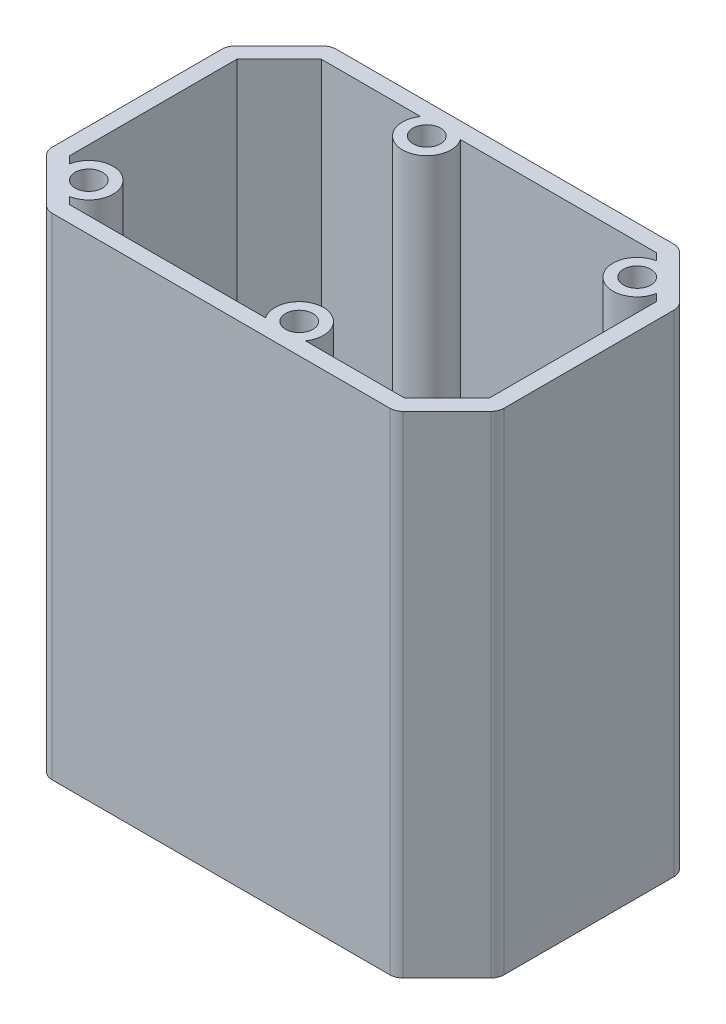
from build123d import *

# Parameters (mm, degrees)
SKETCH1_R           = 2.125
BOSS_EXTRUDE2_DEPTH = 76


with BuildPart() as part:
    # Sketch1 → Boss-Extrude2 (new body)
    with BuildSketch(Plane(origin=(0, 0, 0), x_dir=(1, 0, 0), z_dir=(0, 1, 0))):
        with BuildLine():
            ThreePointArc((27.585786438, 21.414213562), (26.93693974, 21.847759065), (26.171572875, 22))
            Line((26.171572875, 22), (-26.171572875, 22))
            ThreePointArc((-26.171572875, 22), (-26.93693974, 21.847759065), (-27.585786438, 21.414213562))
            Line((-27.585786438, 21.414213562), (-34.414213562, 14.585786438))
            ThreePointArc((-34.414213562, 14.585786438), (-34.847759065, 13.93693974), (-35, 13.171572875))
            Line((-35, 13.171572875), (-35, -13.171572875))
            ThreePointArc((-35, -13.171572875), (-34.847759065, -13.93693974), (-34.414213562, -14.585786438))
            Line((-34.414213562, -14.585786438), (-27.585786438, -21.414213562))
            ThreePointArc((-27.585786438, -21.414213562), (-26.93693974, -21.847759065), (-26.171572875, -22))
            Line((-26.171572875, -22), (26.171572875, -22))
            ThreePointArc((26.171572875, -22), (26.93693974, -21.847759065), (27.585786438, -21.414213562))
            Line((27.585786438, -21.414213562), (34.414213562, -14.585786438))
            ThreePointArc((34.414213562, -14.585786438), (34.847759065, -13.93693974), (35, -13.171572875))
            Line((35, -13.171572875), (35, 13.171572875))
            ThreePointArc((35, 13.171572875), (34.847759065, 13.93693974), (34.414213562, 14.585786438))
            Line((34.414213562, 14.585786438), (27.585786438, 21.414213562))
        make_face()
        with BuildLine():
            Line((-32.5, -12.964466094), (-32.5, 12.964466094))
            Line((-32.5, 12.964466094), (-25.964466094, 19.5))
            Line((-25.964466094, 19.5), (-10.589801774, 19.5))
            ThreePointArc((-10.589801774, 19.5), (-7.5, 13.625), (-4.410198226, 19.5))
            Line((-4.410198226, 19.5), (25.964466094, 19.5))
            Line((25.964466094, 19.5), (27.04741326, 18.417052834))
            ThreePointArc((27.04741326, 18.417052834), (25.077980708, 12.077980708), (31.417052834, 14.04741326))
            Line((31.417052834, 14.04741326), (32.5, 12.964466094))
            Line((32.5, 12.964466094), (32.5, -12.964466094))
            Line((32.5, -12.964466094), (25.964466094, -19.5))
            Line((25.964466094, -19.5), (10.589801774, -19.5))
            ThreePointArc((10.589801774, -19.5), (7.5, -13.625), (4.410198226, -19.5))
            Line((4.410198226, -19.5), (-25.964466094, -19.5))
            Line((-25.964466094, -19.5), (-27.04741326, -18.417052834))
            ThreePointArc((-27.04741326, -18.417052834), (-25.077980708, -12.077980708), (-31.417052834, -14.04741326))
            Line((-31.417052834, -14.04741326), (-32.5, -12.964466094))
        make_face(mode=Mode.SUBTRACT)
        with Locations(Location((-27.729631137, -14.729631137, 0), (0, 0, 270))):
            Circle(SKETCH1_R, mode=Mode.SUBTRACT)
        with Locations(Location((-7.5, 17.375, 0), (0, 0, 270))):
            Circle(SKETCH1_R, mode=Mode.SUBTRACT)
        with Locations(Location((7.5, -17.375, 0), (0, 0, 270))):
            Circle(SKETCH1_R, mode=Mode.SUBTRACT)
        with Locations(Location((27.729631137, 14.729631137, 0), (0, 0, 270))):
            Circle(SKETCH1_R, mode=Mode.SUBTRACT)
    extrude(amount=BOSS_EXTRUDE2_DEPTH)


solid = part.part
